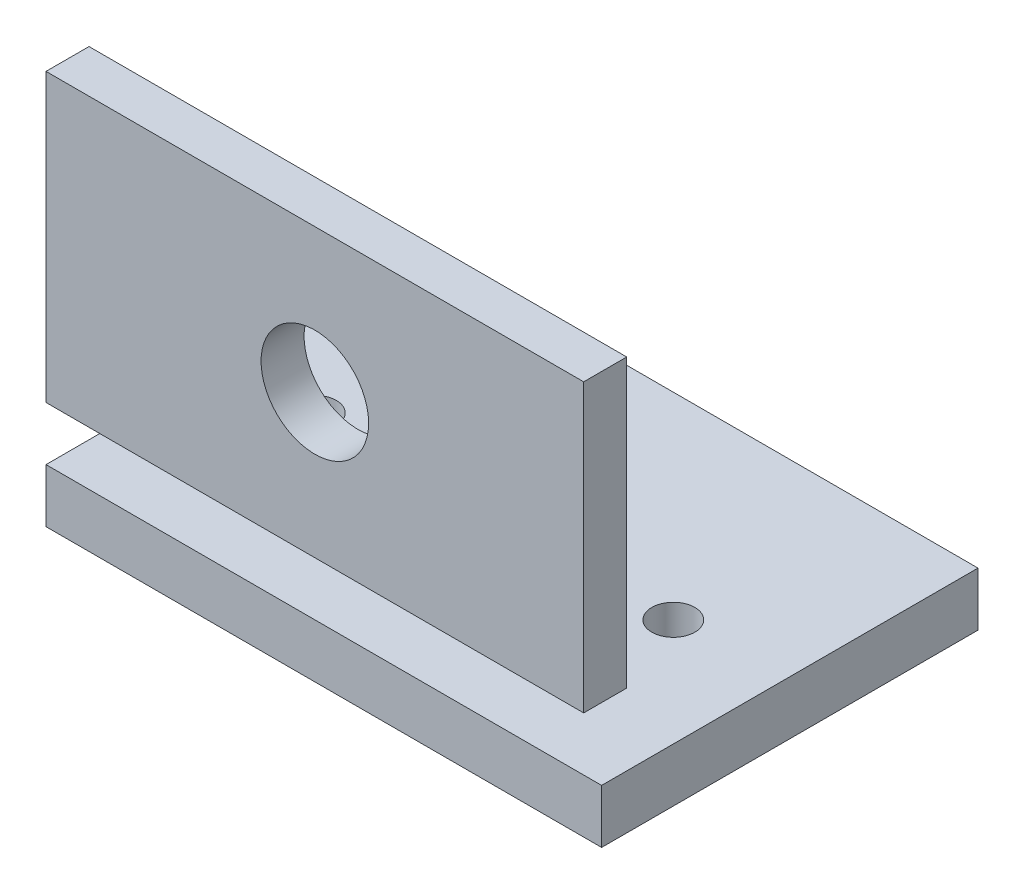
from build123d import *

# Parameters (mm, degrees)
BASESKETCH_W        = 155
BASESKETCH_H        = 105
BASEBOSS_DEPTH      = 15
MOUNTHOLESSKETCH_R  = 6
MOUNTHOLESCUT_DEPTH = 15
UPRIGHTSKETCH_W     = 150
UPRIGHTSKETCH_H     = 80
UPRIGHTBOSS_DEPTH   = 12
SHAFTBORESKETCH_R   = 15
SHAFTBORECUT_DEPTH  = 12


with BuildPart() as part:
    # BaseSketch → BaseBoss (new body)
    with BuildSketch(Plane(origin=(0, 0, 0), x_dir=(1, 0, 0), z_dir=(0, 1, 0))):
        with Locations((77.5, 52.5)):
            Rectangle(BASESKETCH_W, BASESKETCH_H)
    extrude(amount=-BASEBOSS_DEPTH)

    # MountHolesSketch → MountHolesCut (cut)
    with BuildSketch(Plane(origin=(0, 0, 0), x_dir=(1, 0, 0), z_dir=(0, 1, 0))):
        with Locations(Location((25, 50, 0), (0, 0, 270))):
            Circle(MOUNTHOLESSKETCH_R)
        with Locations(Location((125, 50, 0), (0, 0, 270))):
            Circle(MOUNTHOLESSKETCH_R)
    extrude(amount=-MOUNTHOLESCUT_DEPTH, mode=Mode.SUBTRACT)


with BuildPart() as body_2:
    # UprightSketch → UprightBoss (new body)
    with BuildSketch(Plane.XY):
        with Locations((75, 55)):
            Rectangle(UPRIGHTSKETCH_W, UPRIGHTSKETCH_H)
    extrude(amount=-UPRIGHTBOSS_DEPTH)

    # ShaftBoreSketch → ShaftBoreCut (cut)
    with BuildSketch(Plane.XY):
        with Locations((75, 55)):
            Circle(SHAFTBORESKETCH_R)
    extrude(amount=-SHAFTBORECUT_DEPTH, mode=Mode.SUBTRACT)


solid = Compound([part.part, body_2.part])
